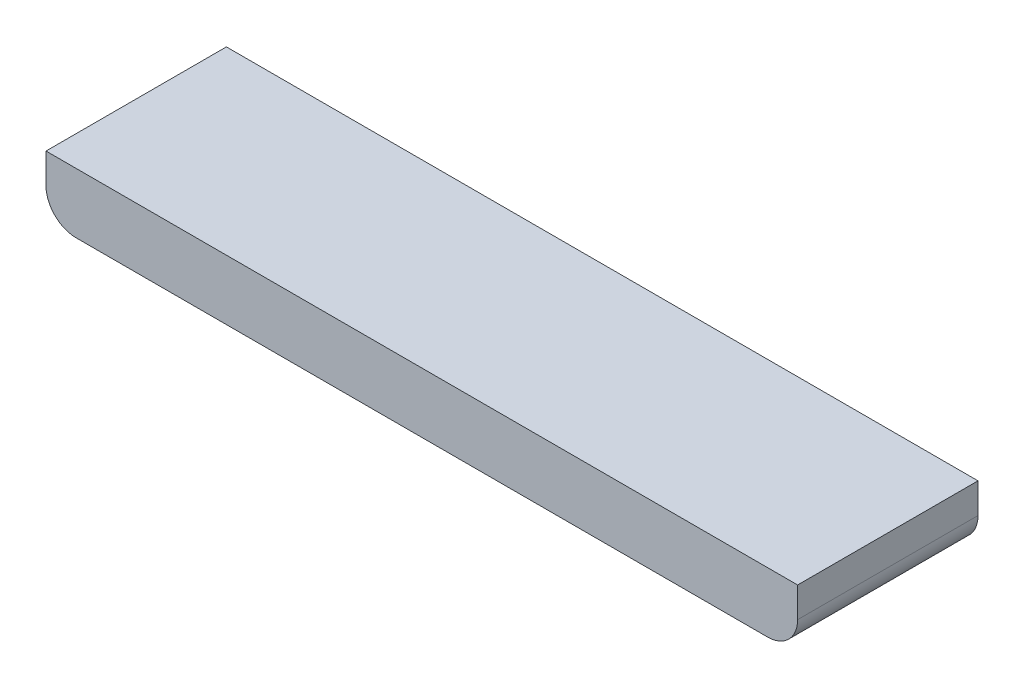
from build123d import *

# Parameters (mm, degrees)
BOSS_EXTRUDE1_DEPTH      = 60
BOSS_EXTRUDE1_DEPTH_BACK = 60
SKETCH1_W                = 500
SKETCH1_H                = 40
FILLET1_R                = 20
FILLET2_R                = 20


with BuildPart() as part:
    # Sketch1 → Boss-Extrude1 (new, two sides: drawn at the far end of the back side and taken through both)
    with BuildSketch(Plane.XY.offset(-BOSS_EXTRUDE1_DEPTH_BACK)):
        Rectangle(SKETCH1_W, SKETCH1_H)
    extrude(amount=BOSS_EXTRUDE1_DEPTH + BOSS_EXTRUDE1_DEPTH_BACK)

    # Fillet1
    fillet1_edges = [part.edges().sort_by_distance(p)[0] for p in [
        (250, -20, 0),
    ]]
    fillet(fillet1_edges, radius=FILLET1_R)

    # Fillet2
    fillet2_edges = [part.edges().sort_by_distance(p)[0] for p in [
        (-250, -20, 0),
    ]]
    fillet(fillet2_edges, radius=FILLET2_R)


solid = part.part
